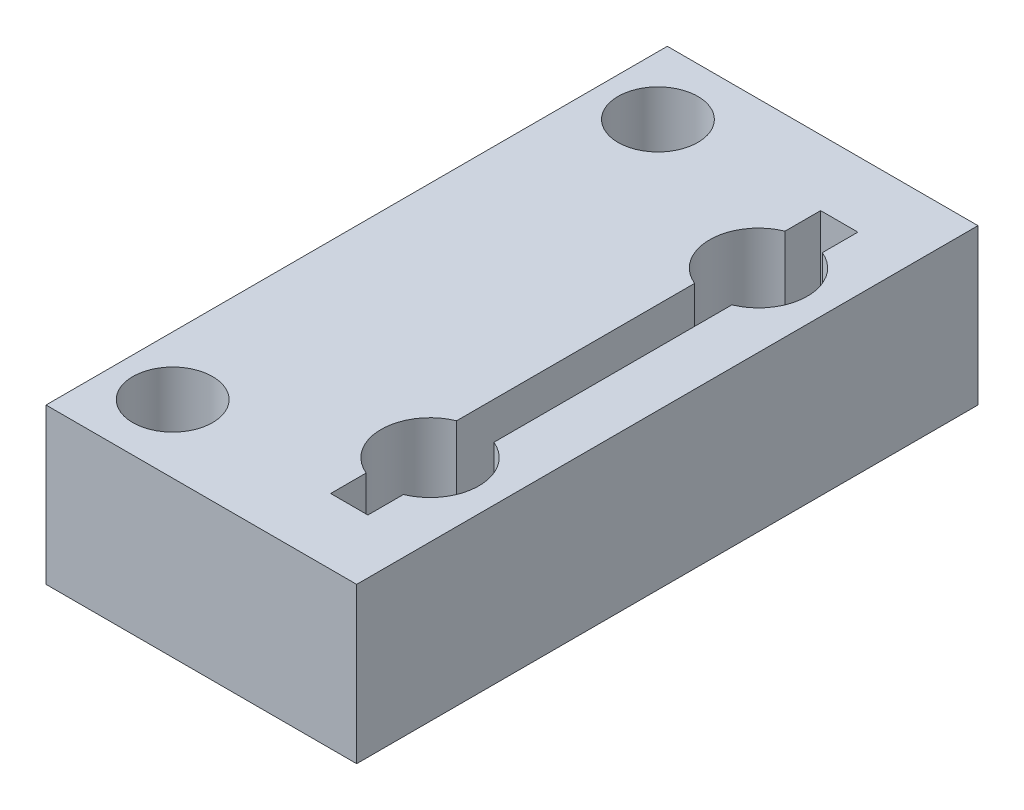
ISO-10303-21;
HEADER;
FILE_DESCRIPTION(('STEP AP214'),'2;1');
FILE_NAME('part.step','',(''),(''),'','','');
FILE_SCHEMA(('AUTOMOTIVE_DESIGN { 1 0 10303 214 1 1 1 1 }'));
ENDSEC;
DATA;
#1=APPLICATION_CONTEXT('core data for automotive mechanical design processes');
#2=APPLICATION_PROTOCOL_DEFINITION('international standard','automotive_design',2000,#1);
#3=PRODUCT_CONTEXT('',#1,'mechanical');
#4=PRODUCT('Part','Part','',(#3));
#5=PRODUCT_RELATED_PRODUCT_CATEGORY('part','',(#4));
#6=PRODUCT_DEFINITION_FORMATION('','',#4);
#7=PRODUCT_DEFINITION_CONTEXT('part definition',#1,'design');
#8=PRODUCT_DEFINITION('design','',#6,#7);
#9=PRODUCT_DEFINITION_SHAPE('','',#8);
#10=(LENGTH_UNIT() NAMED_UNIT(*) SI_UNIT(.MILLI.,.METRE.));
#11=(NAMED_UNIT(*) PLANE_ANGLE_UNIT() SI_UNIT($,.RADIAN.));
#12=(NAMED_UNIT(*) SI_UNIT($,.STERADIAN.) SOLID_ANGLE_UNIT());
#13=UNCERTAINTY_MEASURE_WITH_UNIT(LENGTH_MEASURE(1.E-05),#10,'distance_accuracy_value','');
#14=(GEOMETRIC_REPRESENTATION_CONTEXT(3) GLOBAL_UNCERTAINTY_ASSIGNED_CONTEXT((#13)) GLOBAL_UNIT_ASSIGNED_CONTEXT((#10,
#11,#12)) REPRESENTATION_CONTEXT('',''));
#15=CARTESIAN_POINT('',(0.,0.,0.));
#16=DIRECTION('',(0.,0.,1.));
#17=DIRECTION('',(1.,0.,0.));
#18=AXIS2_PLACEMENT_3D('',#15,#16,#17);
#19=CARTESIAN_POINT('',(-6.34999999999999,3.175,-12.7));
#20=DIRECTION('',(1.,0.,0.));
#21=DIRECTION('',(0.,0.,-1.));
#22=AXIS2_PLACEMENT_3D('',#19,#20,#21);
#23=PLANE('',#22);
#24=DIRECTION('',(0.,0.,1.));
#25=VECTOR('',#24,1.);
#26=CARTESIAN_POINT('',(-6.34999999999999,-3.175,-12.7));
#27=LINE('',#26,#25);
#28=CARTESIAN_POINT('',(-6.34999999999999,-3.175,-12.7));
#29=VERTEX_POINT('',#28);
#30=CARTESIAN_POINT('',(-6.35,-3.175,12.7));
#31=VERTEX_POINT('',#30);
#32=EDGE_CURVE('E229',#29,#31,#27,.T.);
#33=ORIENTED_EDGE('',*,*,#32,.T.);
#34=DIRECTION('',(0.,-1.,0.));
#35=VECTOR('',#34,1.);
#36=CARTESIAN_POINT('',(-6.35,3.175,12.7));
#37=LINE('',#36,#35);
#38=CARTESIAN_POINT('',(-6.35,3.175,12.7));
#39=VERTEX_POINT('',#38);
#40=EDGE_CURVE('E11',#39,#31,#37,.T.);
#41=ORIENTED_EDGE('',*,*,#40,.F.);
#42=DIRECTION('',(0.,0.,1.));
#43=VECTOR('',#42,1.);
#44=CARTESIAN_POINT('',(-6.34999999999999,3.175,-12.7));
#45=LINE('',#44,#43);
#46=CARTESIAN_POINT('',(-6.34999999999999,3.175,-12.7));
#47=VERTEX_POINT('',#46);
#48=EDGE_CURVE('E249',#47,#39,#45,.T.);
#49=ORIENTED_EDGE('',*,*,#48,.F.);
#50=DIRECTION('',(0.,-1.,0.));
#51=VECTOR('',#50,1.);
#52=CARTESIAN_POINT('',(-6.34999999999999,3.175,-12.7));
#53=LINE('',#52,#51);
#54=EDGE_CURVE('E259',#47,#29,#53,.T.);
#55=ORIENTED_EDGE('',*,*,#54,.T.);
#56=EDGE_LOOP('',(#33,#41,#49,#55));
#57=FACE_BOUND('',#56,.T.);
#58=ADVANCED_FACE('F33',(#57),#23,.F.);
#59=CARTESIAN_POINT('',(-6.35,3.175,12.7));
#60=DIRECTION('',(0.,0.,-1.));
#61=DIRECTION('',(-1.,0.,0.));
#62=AXIS2_PLACEMENT_3D('',#59,#60,#61);
#63=PLANE('',#62);
#64=DIRECTION('',(1.,0.,0.));
#65=VECTOR('',#64,1.);
#66=CARTESIAN_POINT('',(-6.35,-3.175,12.7));
#67=LINE('',#66,#65);
#68=CARTESIAN_POINT('',(6.35,-3.175,12.7));
#69=VERTEX_POINT('',#68);
#70=EDGE_CURVE('E262',#31,#69,#67,.T.);
#71=ORIENTED_EDGE('',*,*,#70,.T.);
#72=DIRECTION('',(0.,-1.,0.));
#73=VECTOR('',#72,1.);
#74=CARTESIAN_POINT('',(6.35,3.175,12.7));
#75=LINE('',#74,#73);
#76=CARTESIAN_POINT('',(6.35,3.175,12.7));
#77=VERTEX_POINT('',#76);
#78=EDGE_CURVE('E40',#77,#69,#75,.T.);
#79=ORIENTED_EDGE('',*,*,#78,.F.);
#80=DIRECTION('',(1.,0.,0.));
#81=VECTOR('',#80,1.);
#82=CARTESIAN_POINT('',(-6.35,3.175,12.7));
#83=LINE('',#82,#81);
#84=EDGE_CURVE('E252',#39,#77,#83,.T.);
#85=ORIENTED_EDGE('',*,*,#84,.F.);
#86=ORIENTED_EDGE('',*,*,#40,.T.);
#87=EDGE_LOOP('',(#71,#79,#85,#86));
#88=FACE_BOUND('',#87,.T.);
#89=ADVANCED_FACE('F290',(#88),#63,.F.);
#90=CARTESIAN_POINT('',(6.35,3.175,-12.7));
#91=DIRECTION('',(-1.,0.,0.));
#92=DIRECTION('',(0.,0.,1.));
#93=AXIS2_PLACEMENT_3D('',#90,#91,#92);
#94=PLANE('',#93);
#95=DIRECTION('',(0.,0.,-1.));
#96=VECTOR('',#95,1.);
#97=CARTESIAN_POINT('',(6.35,-3.175,-12.7));
#98=LINE('',#97,#96);
#99=CARTESIAN_POINT('',(6.35,-3.175,-12.7));
#100=VERTEX_POINT('',#99);
#101=EDGE_CURVE('E264',#69,#100,#98,.T.);
#102=ORIENTED_EDGE('',*,*,#101,.T.);
#103=DIRECTION('',(0.,-1.,0.));
#104=VECTOR('',#103,1.);
#105=CARTESIAN_POINT('',(6.35,3.175,-12.7));
#106=LINE('',#105,#104);
#107=CARTESIAN_POINT('',(6.35,3.175,-12.7));
#108=VERTEX_POINT('',#107);
#109=EDGE_CURVE('E269',#108,#100,#106,.T.);
#110=ORIENTED_EDGE('',*,*,#109,.F.);
#111=DIRECTION('',(0.,0.,-1.));
#112=VECTOR('',#111,1.);
#113=CARTESIAN_POINT('',(6.35,3.175,-12.7));
#114=LINE('',#113,#112);
#115=EDGE_CURVE('E255',#77,#108,#114,.T.);
#116=ORIENTED_EDGE('',*,*,#115,.F.);
#117=ORIENTED_EDGE('',*,*,#78,.T.);
#118=EDGE_LOOP('',(#102,#110,#116,#117));
#119=FACE_BOUND('',#118,.T.);
#120=ADVANCED_FACE('F276',(#119),#94,.F.);
#121=CARTESIAN_POINT('',(-6.34999999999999,3.175,-12.7));
#122=DIRECTION('',(0.,0.,1.));
#123=DIRECTION('',(1.,0.,0.));
#124=AXIS2_PLACEMENT_3D('',#121,#122,#123);
#125=PLANE('',#124);
#126=DIRECTION('',(-1.,0.,0.));
#127=VECTOR('',#126,1.);
#128=CARTESIAN_POINT('',(-6.34999999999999,-3.175,-12.7));
#129=LINE('',#128,#127);
#130=EDGE_CURVE('E253',#100,#29,#129,.T.);
#131=ORIENTED_EDGE('',*,*,#130,.T.);
#132=ORIENTED_EDGE('',*,*,#54,.F.);
#133=DIRECTION('',(-1.,0.,0.));
#134=VECTOR('',#133,1.);
#135=CARTESIAN_POINT('',(-6.34999999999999,3.175,-12.7));
#136=LINE('',#135,#134);
#137=EDGE_CURVE('E257',#108,#47,#136,.T.);
#138=ORIENTED_EDGE('',*,*,#137,.F.);
#139=ORIENTED_EDGE('',*,*,#109,.T.);
#140=EDGE_LOOP('',(#131,#132,#138,#139));
#141=FACE_BOUND('',#140,.T.);
#142=ADVANCED_FACE('F283',(#141),#125,.F.);
#143=CARTESIAN_POINT('',(-6.35,3.175,12.7));
#144=DIRECTION('',(0.,1.,0.));
#145=DIRECTION('',(0.,0.,1.));
#146=AXIS2_PLACEMENT_3D('',#143,#144,#145);
#147=PLANE('',#146);
#148=CARTESIAN_POINT('',(-3.95230419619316,3.175,9.9187));
#149=DIRECTION('',(0.,1.,0.));
#150=DIRECTION('',(0.,0.,1.));
#151=AXIS2_PLACEMENT_3D('',#148,#149,#150);
#152=CIRCLE('',#151,1.63194999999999);
#153=CARTESIAN_POINT('',(-3.95230419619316,3.175,11.55065));
#154=VERTEX_POINT('',#153);
#155=EDGE_CURVE('E364',#154,#154,#152,.T.);
#156=ORIENTED_EDGE('',*,*,#155,.F.);
#157=EDGE_LOOP('',(#156));
#158=FACE_BOUND('',#157,.T.);
#159=CARTESIAN_POINT('',(-3.95230419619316,3.175,-9.9187));
#160=DIRECTION('',(0.,1.,0.));
#161=DIRECTION('',(0.,0.,1.));
#162=AXIS2_PLACEMENT_3D('',#159,#160,#161);
#163=CIRCLE('',#162,1.63194999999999);
#164=CARTESIAN_POINT('',(-3.95230419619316,3.175,-8.28675000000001));
#165=VERTEX_POINT('',#164);
#166=EDGE_CURVE('E170',#165,#165,#163,.T.);
#167=ORIENTED_EDGE('',*,*,#166,.F.);
#168=EDGE_LOOP('',(#167));
#169=FACE_BOUND('',#168,.T.);
#170=CARTESIAN_POINT('',(3.36289580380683,3.175,6.71322));
#171=DIRECTION('',(0.,1.,0.));
#172=DIRECTION('',(0.,0.,1.));
#173=AXIS2_PLACEMENT_3D('',#170,#171,#172);
#174=CIRCLE('',#173,2.);
#175=CARTESIAN_POINT('',(4.12489580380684,3.175,8.56237007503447));
#176=VERTEX_POINT('',#175);
#177=CARTESIAN_POINT('',(4.12489580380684,3.175,4.86406992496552));
#178=VERTEX_POINT('',#177);
#179=EDGE_CURVE('E47',#176,#178,#174,.T.);
#180=ORIENTED_EDGE('',*,*,#179,.F.);
#181=DIRECTION('',(0.,0.,-1.));
#182=VECTOR('',#181,1.);
#183=CARTESIAN_POINT('',(4.12489580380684,3.175,10.01522));
#184=LINE('',#183,#182);
#185=CARTESIAN_POINT('',(4.12489580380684,3.175,10.01522));
#186=VERTEX_POINT('',#185);
#187=EDGE_CURVE('E164',#186,#176,#184,.T.);
#188=ORIENTED_EDGE('',*,*,#187,.F.);
#189=DIRECTION('',(1.,0.,0.));
#190=VECTOR('',#189,1.);
#191=CARTESIAN_POINT('',(4.12489580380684,3.175,10.01522));
#192=LINE('',#191,#190);
#193=CARTESIAN_POINT('',(2.60089580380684,3.175,10.01522));
#194=VERTEX_POINT('',#193);
#195=EDGE_CURVE('E167',#194,#186,#192,.T.);
#196=ORIENTED_EDGE('',*,*,#195,.F.);
#197=DIRECTION('',(0.,0.,1.));
#198=VECTOR('',#197,1.);
#199=CARTESIAN_POINT('',(2.60089580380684,3.175,10.01522));
#200=LINE('',#199,#198);
#201=CARTESIAN_POINT('',(2.60089580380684,3.175,8.56237007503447));
#202=VERTEX_POINT('',#201);
#203=EDGE_CURVE('E222',#202,#194,#200,.T.);
#204=ORIENTED_EDGE('',*,*,#203,.F.);
#205=CARTESIAN_POINT('',(3.36289580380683,3.175,6.71322));
#206=DIRECTION('',(0.,1.,0.));
#207=DIRECTION('',(0.,0.,1.));
#208=AXIS2_PLACEMENT_3D('',#205,#206,#207);
#209=CIRCLE('',#208,2.);
#210=CARTESIAN_POINT('',(2.60089580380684,3.175,4.86406992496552));
#211=VERTEX_POINT('',#210);
#212=EDGE_CURVE('E219',#211,#202,#209,.T.);
#213=ORIENTED_EDGE('',*,*,#212,.F.);
#214=DIRECTION('',(0.,0.,1.));
#215=VECTOR('',#214,1.);
#216=CARTESIAN_POINT('',(2.60089580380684,3.175,4.86406992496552));
#217=LINE('',#216,#215);
#218=CARTESIAN_POINT('',(2.60089580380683,3.175,-4.86406992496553));
#219=VERTEX_POINT('',#218);
#220=EDGE_CURVE('E216',#219,#211,#217,.T.);
#221=ORIENTED_EDGE('',*,*,#220,.F.);
#222=CARTESIAN_POINT('',(3.36289580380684,3.175,-6.71322));
#223=DIRECTION('',(0.,1.,0.));
#224=DIRECTION('',(0.,0.,1.));
#225=AXIS2_PLACEMENT_3D('',#222,#223,#224);
#226=CIRCLE('',#225,2.);
#227=CARTESIAN_POINT('',(2.60089580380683,3.175,-8.56237007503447));
#228=VERTEX_POINT('',#227);
#229=EDGE_CURVE('E213',#228,#219,#226,.T.);
#230=ORIENTED_EDGE('',*,*,#229,.F.);
#231=DIRECTION('',(0.,0.,1.));
#232=VECTOR('',#231,1.);
#233=CARTESIAN_POINT('',(2.60089580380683,3.175,-8.56237007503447));
#234=LINE('',#233,#232);
#235=CARTESIAN_POINT('',(2.60089580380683,3.175,-10.01522));
#236=VERTEX_POINT('',#235);
#237=EDGE_CURVE('E210',#236,#228,#234,.T.);
#238=ORIENTED_EDGE('',*,*,#237,.F.);
#239=DIRECTION('',(-1.,0.,0.));
#240=VECTOR('',#239,1.);
#241=CARTESIAN_POINT('',(4.12489580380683,3.175,-10.01522));
#242=LINE('',#241,#240);
#243=CARTESIAN_POINT('',(4.12489580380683,3.175,-10.01522));
#244=VERTEX_POINT('',#243);
#245=EDGE_CURVE('E207',#244,#236,#242,.T.);
#246=ORIENTED_EDGE('',*,*,#245,.F.);
#247=DIRECTION('',(0.,0.,-1.));
#248=VECTOR('',#247,1.);
#249=CARTESIAN_POINT('',(4.12489580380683,3.175,-8.56237007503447));
#250=LINE('',#249,#248);
#251=CARTESIAN_POINT('',(4.12489580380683,3.175,-8.56237007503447));
#252=VERTEX_POINT('',#251);
#253=EDGE_CURVE('E204',#252,#244,#250,.T.);
#254=ORIENTED_EDGE('',*,*,#253,.F.);
#255=CARTESIAN_POINT('',(3.36289580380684,3.175,-6.71322));
#256=DIRECTION('',(0.,1.,0.));
#257=DIRECTION('',(0.,0.,1.));
#258=AXIS2_PLACEMENT_3D('',#255,#256,#257);
#259=CIRCLE('',#258,2.);
#260=CARTESIAN_POINT('',(4.12489580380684,3.175,-4.86406992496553));
#261=VERTEX_POINT('',#260);
#262=EDGE_CURVE('E201',#261,#252,#259,.T.);
#263=ORIENTED_EDGE('',*,*,#262,.F.);
#264=DIRECTION('',(0.,0.,-1.));
#265=VECTOR('',#264,1.);
#266=CARTESIAN_POINT('',(4.12489580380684,3.175,4.86406992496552));
#267=LINE('',#266,#265);
#268=EDGE_CURVE('E199',#178,#261,#267,.T.);
#269=ORIENTED_EDGE('',*,*,#268,.F.);
#270=EDGE_LOOP('',(#180,#188,#196,#204,#213,#221,#230,#238,#246,#254,#263,#269));
#271=FACE_BOUND('',#270,.T.);
#272=ORIENTED_EDGE('',*,*,#48,.T.);
#273=ORIENTED_EDGE('',*,*,#84,.T.);
#274=ORIENTED_EDGE('',*,*,#115,.T.);
#275=ORIENTED_EDGE('',*,*,#137,.T.);
#276=EDGE_LOOP('',(#272,#273,#274,#275));
#277=FACE_BOUND('',#276,.T.);
#278=ADVANCED_FACE('F289',(#158,#169,#271,#277),#147,.T.);
#279=CARTESIAN_POINT('',(-6.35,-3.175,12.7));
#280=DIRECTION('',(0.,1.,0.));
#281=DIRECTION('',(0.,0.,1.));
#282=AXIS2_PLACEMENT_3D('',#279,#280,#281);
#283=PLANE('',#282);
#284=CARTESIAN_POINT('',(-3.95230419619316,-3.175,9.9187));
#285=DIRECTION('',(0.,1.,0.));
#286=DIRECTION('',(0.,0.,1.));
#287=AXIS2_PLACEMENT_3D('',#284,#285,#286);
#288=CIRCLE('',#287,1.63195);
#289=CARTESIAN_POINT('',(-3.95230419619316,-3.175,11.55065));
#290=VERTEX_POINT('',#289);
#291=EDGE_CURVE('E361',#290,#290,#288,.T.);
#292=ORIENTED_EDGE('',*,*,#291,.T.);
#293=EDGE_LOOP('',(#292));
#294=FACE_BOUND('',#293,.T.);
#295=CARTESIAN_POINT('',(-3.95230419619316,-3.175,-9.9187));
#296=DIRECTION('',(0.,1.,0.));
#297=DIRECTION('',(0.,0.,1.));
#298=AXIS2_PLACEMENT_3D('',#295,#296,#297);
#299=CIRCLE('',#298,1.63195);
#300=CARTESIAN_POINT('',(-3.95230419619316,-3.175,-8.28675));
#301=VERTEX_POINT('',#300);
#302=EDGE_CURVE('E365',#301,#301,#299,.T.);
#303=ORIENTED_EDGE('',*,*,#302,.T.);
#304=EDGE_LOOP('',(#303));
#305=FACE_BOUND('',#304,.T.);
#306=DIRECTION('',(0.,0.,-1.));
#307=VECTOR('',#306,1.);
#308=CARTESIAN_POINT('',(4.12489580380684,-3.175,10.01522));
#309=LINE('',#308,#307);
#310=CARTESIAN_POINT('',(4.12489580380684,-3.175,10.01522));
#311=VERTEX_POINT('',#310);
#312=CARTESIAN_POINT('',(4.12489580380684,-3.175,8.56237007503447));
#313=VERTEX_POINT('',#312);
#314=EDGE_CURVE('E153',#311,#313,#309,.T.);
#315=ORIENTED_EDGE('',*,*,#314,.T.);
#316=CARTESIAN_POINT('',(3.36289580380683,-3.175,6.71322));
#317=DIRECTION('',(0.,1.,0.));
#318=DIRECTION('',(0.,0.,1.));
#319=AXIS2_PLACEMENT_3D('',#316,#317,#318);
#320=CIRCLE('',#319,2.);
#321=CARTESIAN_POINT('',(4.12489580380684,-3.175,4.86406992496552));
#322=VERTEX_POINT('',#321);
#323=EDGE_CURVE('E147',#313,#322,#320,.T.);
#324=ORIENTED_EDGE('',*,*,#323,.T.);
#325=DIRECTION('',(0.,0.,-1.));
#326=VECTOR('',#325,1.);
#327=CARTESIAN_POINT('',(4.12489580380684,-3.175,4.86406992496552));
#328=LINE('',#327,#326);
#329=CARTESIAN_POINT('',(4.12489580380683,-3.175,-4.86406992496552));
#330=VERTEX_POINT('',#329);
#331=EDGE_CURVE('E156',#322,#330,#328,.T.);
#332=ORIENTED_EDGE('',*,*,#331,.T.);
#333=CARTESIAN_POINT('',(3.36289580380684,-3.175,-6.71322));
#334=DIRECTION('',(0.,1.,0.));
#335=DIRECTION('',(0.,0.,1.));
#336=AXIS2_PLACEMENT_3D('',#333,#334,#335);
#337=CIRCLE('',#336,2.);
#338=CARTESIAN_POINT('',(4.12489580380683,-3.175,-8.56237007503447));
#339=VERTEX_POINT('',#338);
#340=EDGE_CURVE('E55',#330,#339,#337,.T.);
#341=ORIENTED_EDGE('',*,*,#340,.T.);
#342=DIRECTION('',(0.,0.,-1.));
#343=VECTOR('',#342,1.);
#344=CARTESIAN_POINT('',(4.12489580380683,-3.175,-8.56237007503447));
#345=LINE('',#344,#343);
#346=CARTESIAN_POINT('',(4.12489580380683,-3.175,-10.01522));
#347=VERTEX_POINT('',#346);
#348=EDGE_CURVE('E174',#339,#347,#345,.T.);
#349=ORIENTED_EDGE('',*,*,#348,.T.);
#350=DIRECTION('',(-1.,0.,0.));
#351=VECTOR('',#350,1.);
#352=CARTESIAN_POINT('',(4.12489580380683,-3.175,-10.01522));
#353=LINE('',#352,#351);
#354=CARTESIAN_POINT('',(2.60089580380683,-3.175,-10.01522));
#355=VERTEX_POINT('',#354);
#356=EDGE_CURVE('E177',#347,#355,#353,.T.);
#357=ORIENTED_EDGE('',*,*,#356,.T.);
#358=DIRECTION('',(0.,0.,1.));
#359=VECTOR('',#358,1.);
#360=CARTESIAN_POINT('',(2.60089580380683,-3.175,-8.56237007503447));
#361=LINE('',#360,#359);
#362=CARTESIAN_POINT('',(2.60089580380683,-3.175,-8.56237007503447));
#363=VERTEX_POINT('',#362);
#364=EDGE_CURVE('E180',#355,#363,#361,.T.);
#365=ORIENTED_EDGE('',*,*,#364,.T.);
#366=CARTESIAN_POINT('',(3.36289580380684,-3.175,-6.71322));
#367=DIRECTION('',(0.,1.,0.));
#368=DIRECTION('',(0.,0.,1.));
#369=AXIS2_PLACEMENT_3D('',#366,#367,#368);
#370=CIRCLE('',#369,2.);
#371=CARTESIAN_POINT('',(2.60089580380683,-3.175,-4.86406992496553));
#372=VERTEX_POINT('',#371);
#373=EDGE_CURVE('E183',#363,#372,#370,.T.);
#374=ORIENTED_EDGE('',*,*,#373,.T.);
#375=DIRECTION('',(0.,0.,1.));
#376=VECTOR('',#375,1.);
#377=CARTESIAN_POINT('',(2.60089580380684,-3.175,4.86406992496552));
#378=LINE('',#377,#376);
#379=CARTESIAN_POINT('',(2.60089580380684,-3.175,4.86406992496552));
#380=VERTEX_POINT('',#379);
#381=EDGE_CURVE('E186',#372,#380,#378,.T.);
#382=ORIENTED_EDGE('',*,*,#381,.T.);
#383=CARTESIAN_POINT('',(3.36289580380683,-3.175,6.71322));
#384=DIRECTION('',(0.,1.,0.));
#385=DIRECTION('',(0.,0.,1.));
#386=AXIS2_PLACEMENT_3D('',#383,#384,#385);
#387=CIRCLE('',#386,2.);
#388=CARTESIAN_POINT('',(2.60089580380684,-3.175,8.56237007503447));
#389=VERTEX_POINT('',#388);
#390=EDGE_CURVE('E189',#380,#389,#387,.T.);
#391=ORIENTED_EDGE('',*,*,#390,.T.);
#392=DIRECTION('',(0.,0.,1.));
#393=VECTOR('',#392,1.);
#394=CARTESIAN_POINT('',(2.60089580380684,-3.175,10.01522));
#395=LINE('',#394,#393);
#396=CARTESIAN_POINT('',(2.60089580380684,-3.175,10.01522));
#397=VERTEX_POINT('',#396);
#398=EDGE_CURVE('E192',#389,#397,#395,.T.);
#399=ORIENTED_EDGE('',*,*,#398,.T.);
#400=DIRECTION('',(1.,0.,0.));
#401=VECTOR('',#400,1.);
#402=CARTESIAN_POINT('',(4.12489580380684,-3.175,10.01522));
#403=LINE('',#402,#401);
#404=EDGE_CURVE('E195',#397,#311,#403,.T.);
#405=ORIENTED_EDGE('',*,*,#404,.T.);
#406=EDGE_LOOP('',(#315,#324,#332,#341,#349,#357,#365,#374,#382,#391,#399,#405));
#407=FACE_BOUND('',#406,.T.);
#408=ORIENTED_EDGE('',*,*,#32,.F.);
#409=ORIENTED_EDGE('',*,*,#130,.F.);
#410=ORIENTED_EDGE('',*,*,#101,.F.);
#411=ORIENTED_EDGE('',*,*,#70,.F.);
#412=EDGE_LOOP('',(#408,#409,#410,#411));
#413=FACE_BOUND('',#412,.T.);
#414=ADVANCED_FACE('F160',(#294,#305,#407,#413),#283,.F.);
#415=CARTESIAN_POINT('',(3.36289580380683,-3.175,6.71322));
#416=DIRECTION('',(0.,1.,0.));
#417=DIRECTION('',(0.,0.,1.));
#418=AXIS2_PLACEMENT_3D('',#415,#416,#417);
#419=CYLINDRICAL_SURFACE('',#418,2.);
#420=ORIENTED_EDGE('',*,*,#179,.T.);
#421=DIRECTION('',(0.,1.,0.));
#422=VECTOR('',#421,1.);
#423=CARTESIAN_POINT('',(4.12489580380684,-3.175,4.86406992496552));
#424=LINE('',#423,#422);
#425=EDGE_CURVE('E143',#322,#178,#424,.T.);
#426=ORIENTED_EDGE('',*,*,#425,.F.);
#427=ORIENTED_EDGE('',*,*,#323,.F.);
#428=DIRECTION('',(0.,1.,0.));
#429=VECTOR('',#428,1.);
#430=CARTESIAN_POINT('',(4.12489580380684,-3.175,8.56237007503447));
#431=LINE('',#430,#429);
#432=EDGE_CURVE('E227',#313,#176,#431,.T.);
#433=ORIENTED_EDGE('',*,*,#432,.T.);
#434=EDGE_LOOP('',(#420,#426,#427,#433));
#435=FACE_BOUND('',#434,.T.);
#436=ADVANCED_FACE('F145',(#435),#419,.F.);
#437=CARTESIAN_POINT('',(4.12489580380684,-3.175,10.01522));
#438=DIRECTION('',(1.,0.,0.));
#439=DIRECTION('',(0.,0.,-1.));
#440=AXIS2_PLACEMENT_3D('',#437,#438,#439);
#441=PLANE('',#440);
#442=ORIENTED_EDGE('',*,*,#187,.T.);
#443=ORIENTED_EDGE('',*,*,#432,.F.);
#444=ORIENTED_EDGE('',*,*,#314,.F.);
#445=DIRECTION('',(0.,1.,0.));
#446=VECTOR('',#445,1.);
#447=CARTESIAN_POINT('',(4.12489580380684,-3.175,10.01522));
#448=LINE('',#447,#446);
#449=EDGE_CURVE('E230',#311,#186,#448,.T.);
#450=ORIENTED_EDGE('',*,*,#449,.T.);
#451=EDGE_LOOP('',(#442,#443,#444,#450));
#452=FACE_BOUND('',#451,.T.);
#453=ADVANCED_FACE('F308',(#452),#441,.F.);
#454=CARTESIAN_POINT('',(4.12489580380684,-3.175,10.01522));
#455=DIRECTION('',(0.,0.,1.));
#456=DIRECTION('',(1.,0.,0.));
#457=AXIS2_PLACEMENT_3D('',#454,#455,#456);
#458=PLANE('',#457);
#459=ORIENTED_EDGE('',*,*,#195,.T.);
#460=ORIENTED_EDGE('',*,*,#449,.F.);
#461=ORIENTED_EDGE('',*,*,#404,.F.);
#462=DIRECTION('',(0.,1.,0.));
#463=VECTOR('',#462,1.);
#464=CARTESIAN_POINT('',(2.60089580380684,-3.175,10.01522));
#465=LINE('',#464,#463);
#466=EDGE_CURVE('E232',#397,#194,#465,.T.);
#467=ORIENTED_EDGE('',*,*,#466,.T.);
#468=EDGE_LOOP('',(#459,#460,#461,#467));
#469=FACE_BOUND('',#468,.T.);
#470=ADVANCED_FACE('F342',(#469),#458,.F.);
#471=CARTESIAN_POINT('',(2.60089580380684,-3.175,10.01522));
#472=DIRECTION('',(-1.,0.,0.));
#473=DIRECTION('',(0.,0.,1.));
#474=AXIS2_PLACEMENT_3D('',#471,#472,#473);
#475=PLANE('',#474);
#476=ORIENTED_EDGE('',*,*,#203,.T.);
#477=ORIENTED_EDGE('',*,*,#466,.F.);
#478=ORIENTED_EDGE('',*,*,#398,.F.);
#479=DIRECTION('',(0.,1.,0.));
#480=VECTOR('',#479,1.);
#481=CARTESIAN_POINT('',(2.60089580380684,-3.175,8.56237007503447));
#482=LINE('',#481,#480);
#483=EDGE_CURVE('E234',#389,#202,#482,.T.);
#484=ORIENTED_EDGE('',*,*,#483,.T.);
#485=EDGE_LOOP('',(#476,#477,#478,#484));
#486=FACE_BOUND('',#485,.T.);
#487=ADVANCED_FACE('F338',(#486),#475,.F.);
#488=CARTESIAN_POINT('',(3.36289580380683,-3.175,6.71322));
#489=DIRECTION('',(0.,1.,0.));
#490=DIRECTION('',(0.,0.,1.));
#491=AXIS2_PLACEMENT_3D('',#488,#489,#490);
#492=CYLINDRICAL_SURFACE('',#491,2.);
#493=ORIENTED_EDGE('',*,*,#212,.T.);
#494=ORIENTED_EDGE('',*,*,#483,.F.);
#495=ORIENTED_EDGE('',*,*,#390,.F.);
#496=DIRECTION('',(0.,1.,0.));
#497=VECTOR('',#496,1.);
#498=CARTESIAN_POINT('',(2.60089580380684,-3.175,4.86406992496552));
#499=LINE('',#498,#497);
#500=EDGE_CURVE('E236',#380,#211,#499,.T.);
#501=ORIENTED_EDGE('',*,*,#500,.T.);
#502=EDGE_LOOP('',(#493,#494,#495,#501));
#503=FACE_BOUND('',#502,.T.);
#504=ADVANCED_FACE('F334',(#503),#492,.F.);
#505=CARTESIAN_POINT('',(2.60089580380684,-3.175,4.86406992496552));
#506=DIRECTION('',(-1.,0.,0.));
#507=DIRECTION('',(0.,0.,1.));
#508=AXIS2_PLACEMENT_3D('',#505,#506,#507);
#509=PLANE('',#508);
#510=ORIENTED_EDGE('',*,*,#220,.T.);
#511=ORIENTED_EDGE('',*,*,#500,.F.);
#512=ORIENTED_EDGE('',*,*,#381,.F.);
#513=DIRECTION('',(0.,1.,0.));
#514=VECTOR('',#513,1.);
#515=CARTESIAN_POINT('',(2.60089580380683,-3.175,-4.86406992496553));
#516=LINE('',#515,#514);
#517=EDGE_CURVE('E238',#372,#219,#516,.T.);
#518=ORIENTED_EDGE('',*,*,#517,.T.);
#519=EDGE_LOOP('',(#510,#511,#512,#518));
#520=FACE_BOUND('',#519,.T.);
#521=ADVANCED_FACE('F330',(#520),#509,.F.);
#522=CARTESIAN_POINT('',(3.36289580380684,-3.175,-6.71322));
#523=DIRECTION('',(0.,1.,0.));
#524=DIRECTION('',(0.,0.,1.));
#525=AXIS2_PLACEMENT_3D('',#522,#523,#524);
#526=CYLINDRICAL_SURFACE('',#525,2.);
#527=ORIENTED_EDGE('',*,*,#229,.T.);
#528=ORIENTED_EDGE('',*,*,#517,.F.);
#529=ORIENTED_EDGE('',*,*,#373,.F.);
#530=DIRECTION('',(0.,1.,0.));
#531=VECTOR('',#530,1.);
#532=CARTESIAN_POINT('',(2.60089580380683,-3.175,-8.56237007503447));
#533=LINE('',#532,#531);
#534=EDGE_CURVE('E240',#363,#228,#533,.T.);
#535=ORIENTED_EDGE('',*,*,#534,.T.);
#536=EDGE_LOOP('',(#527,#528,#529,#535));
#537=FACE_BOUND('',#536,.T.);
#538=ADVANCED_FACE('F326',(#537),#526,.F.);
#539=CARTESIAN_POINT('',(2.60089580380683,-3.175,-8.56237007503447));
#540=DIRECTION('',(-1.,0.,0.));
#541=DIRECTION('',(0.,0.,1.));
#542=AXIS2_PLACEMENT_3D('',#539,#540,#541);
#543=PLANE('',#542);
#544=ORIENTED_EDGE('',*,*,#237,.T.);
#545=ORIENTED_EDGE('',*,*,#534,.F.);
#546=ORIENTED_EDGE('',*,*,#364,.F.);
#547=DIRECTION('',(0.,1.,0.));
#548=VECTOR('',#547,1.);
#549=CARTESIAN_POINT('',(2.60089580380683,-3.175,-10.01522));
#550=LINE('',#549,#548);
#551=EDGE_CURVE('E242',#355,#236,#550,.T.);
#552=ORIENTED_EDGE('',*,*,#551,.T.);
#553=EDGE_LOOP('',(#544,#545,#546,#552));
#554=FACE_BOUND('',#553,.T.);
#555=ADVANCED_FACE('F322',(#554),#543,.F.);
#556=CARTESIAN_POINT('',(4.12489580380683,-3.175,-10.01522));
#557=DIRECTION('',(0.,0.,-1.));
#558=DIRECTION('',(-1.,0.,0.));
#559=AXIS2_PLACEMENT_3D('',#556,#557,#558);
#560=PLANE('',#559);
#561=ORIENTED_EDGE('',*,*,#245,.T.);
#562=ORIENTED_EDGE('',*,*,#551,.F.);
#563=ORIENTED_EDGE('',*,*,#356,.F.);
#564=DIRECTION('',(0.,1.,0.));
#565=VECTOR('',#564,1.);
#566=CARTESIAN_POINT('',(4.12489580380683,-3.175,-10.01522));
#567=LINE('',#566,#565);
#568=EDGE_CURVE('E244',#347,#244,#567,.T.);
#569=ORIENTED_EDGE('',*,*,#568,.T.);
#570=EDGE_LOOP('',(#561,#562,#563,#569));
#571=FACE_BOUND('',#570,.T.);
#572=ADVANCED_FACE('F318',(#571),#560,.F.);
#573=CARTESIAN_POINT('',(4.12489580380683,-3.175,-8.56237007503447));
#574=DIRECTION('',(1.,0.,0.));
#575=DIRECTION('',(0.,0.,-1.));
#576=AXIS2_PLACEMENT_3D('',#573,#574,#575);
#577=PLANE('',#576);
#578=ORIENTED_EDGE('',*,*,#253,.T.);
#579=ORIENTED_EDGE('',*,*,#568,.F.);
#580=ORIENTED_EDGE('',*,*,#348,.F.);
#581=DIRECTION('',(0.,1.,0.));
#582=VECTOR('',#581,1.);
#583=CARTESIAN_POINT('',(4.12489580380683,-3.175,-8.56237007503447));
#584=LINE('',#583,#582);
#585=EDGE_CURVE('E246',#339,#252,#584,.T.);
#586=ORIENTED_EDGE('',*,*,#585,.T.);
#587=EDGE_LOOP('',(#578,#579,#580,#586));
#588=FACE_BOUND('',#587,.T.);
#589=ADVANCED_FACE('F315',(#588),#577,.F.);
#590=CARTESIAN_POINT('',(3.36289580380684,-3.175,-6.71322));
#591=DIRECTION('',(0.,1.,0.));
#592=DIRECTION('',(0.,0.,1.));
#593=AXIS2_PLACEMENT_3D('',#590,#591,#592);
#594=CYLINDRICAL_SURFACE('',#593,2.);
#595=ORIENTED_EDGE('',*,*,#262,.T.);
#596=ORIENTED_EDGE('',*,*,#585,.F.);
#597=ORIENTED_EDGE('',*,*,#340,.F.);
#598=DIRECTION('',(0.,1.,0.));
#599=VECTOR('',#598,1.);
#600=CARTESIAN_POINT('',(4.12489580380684,-3.175,-4.86406992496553));
#601=LINE('',#600,#599);
#602=EDGE_CURVE('E152',#330,#261,#601,.T.);
#603=ORIENTED_EDGE('',*,*,#602,.T.);
#604=EDGE_LOOP('',(#595,#596,#597,#603));
#605=FACE_BOUND('',#604,.T.);
#606=ADVANCED_FACE('F312',(#605),#594,.F.);
#607=CARTESIAN_POINT('',(4.12489580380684,-3.175,4.86406992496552));
#608=DIRECTION('',(1.,0.,0.));
#609=DIRECTION('',(0.,0.,-1.));
#610=AXIS2_PLACEMENT_3D('',#607,#608,#609);
#611=PLANE('',#610);
#612=ORIENTED_EDGE('',*,*,#268,.T.);
#613=ORIENTED_EDGE('',*,*,#602,.F.);
#614=ORIENTED_EDGE('',*,*,#331,.F.);
#615=ORIENTED_EDGE('',*,*,#425,.T.);
#616=EDGE_LOOP('',(#612,#613,#614,#615));
#617=FACE_BOUND('',#616,.T.);
#618=ADVANCED_FACE('F157',(#617),#611,.F.);
#619=CARTESIAN_POINT('',(-3.95230419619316,3.175,-9.9187));
#620=DIRECTION('',(0.,1.,0.));
#621=DIRECTION('',(0.,0.,1.));
#622=AXIS2_PLACEMENT_3D('',#619,#620,#621);
#623=CYLINDRICAL_SURFACE('',#622,1.63194999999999);
#624=ORIENTED_EDGE('',*,*,#302,.F.);
#625=EDGE_LOOP('',(#624));
#626=FACE_BOUND('',#625,.T.);
#627=ORIENTED_EDGE('',*,*,#166,.T.);
#628=EDGE_LOOP('',(#627));
#629=FACE_BOUND('',#628,.T.);
#630=ADVANCED_FACE('F311',(#626,#629),#623,.F.);
#631=CARTESIAN_POINT('',(-3.95230419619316,3.175,9.9187));
#632=DIRECTION('',(0.,1.,0.));
#633=DIRECTION('',(0.,0.,1.));
#634=AXIS2_PLACEMENT_3D('',#631,#632,#633);
#635=CYLINDRICAL_SURFACE('',#634,1.63194999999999);
#636=ORIENTED_EDGE('',*,*,#291,.F.);
#637=EDGE_LOOP('',(#636));
#638=FACE_BOUND('',#637,.T.);
#639=ORIENTED_EDGE('',*,*,#155,.T.);
#640=EDGE_LOOP('',(#639));
#641=FACE_BOUND('',#640,.T.);
#642=ADVANCED_FACE('F352',(#638,#641),#635,.F.);
#643=CLOSED_SHELL('',(#58,#89,#120,#142,#278,#414,#436,#453,#470,#487,#504,#521,#538,#555,#572,
#589,#606,#618,#630,#642));
#644=MANIFOLD_SOLID_BREP('B2',#643);
#645=ADVANCED_BREP_SHAPE_REPRESENTATION('',(#18,#644),#14);
#646=SHAPE_DEFINITION_REPRESENTATION(#9,#645);
ENDSEC;
END-ISO-10303-21;
